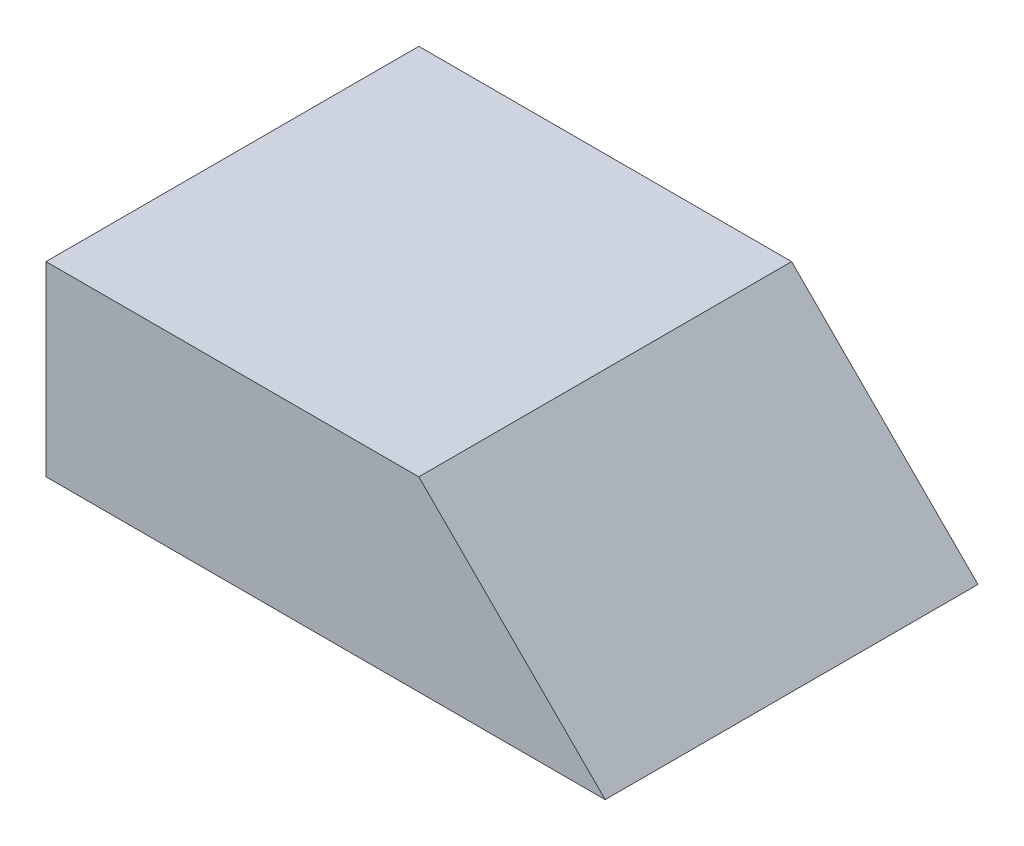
from build123d import *

# Parameters (mm, degrees)
BOSS_EXTRUDE1_DEPTH = 2


with BuildPart() as part:
    # Sketch1 → Boss-Extrude1 (new body)
    with BuildSketch(Plane.XY):
        Polygon((-1, 1), (0, 0), (-3, 0), (-3, 1), align=None)
    extrude(amount=BOSS_EXTRUDE1_DEPTH)


solid = part.part
